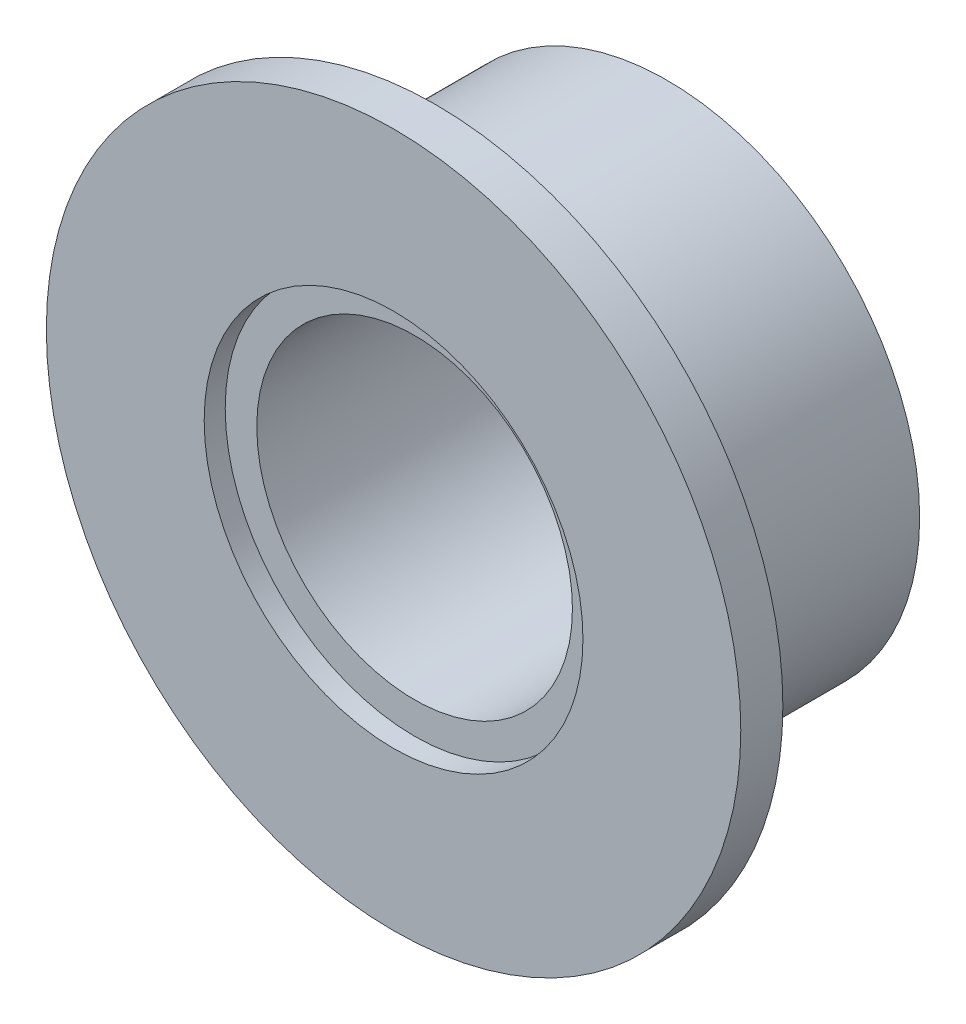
from build123d import *

# Parameters (mm, degrees)
SKETCH2_R           = 12
BOSS_EXTRUDE2_DEPTH = 11
SKETCH3_R           = 16.5
BOSS_EXTRUDE3_DEPTH = 2
HOLE1_D             = 15
HOLE1_DEPTH         = 12999.999913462
HOLE1_CBORE_D       = 18
HOLE1_CBORE_DEPTH   = 1


with BuildPart() as part:
    # Sketch2 → Boss-Extrude2 (new body)
    with BuildSketch(Plane.XY):
        Circle(SKETCH2_R)
    extrude(amount=BOSS_EXTRUDE2_DEPTH)

    # Sketch3 → Boss-Extrude3 (add)
    with BuildSketch(Plane.XY.offset(11)):
        Circle(SKETCH3_R)
    extrude(amount=BOSS_EXTRUDE3_DEPTH)

    # Hole1
    with Locations(Plane.XY.offset(13)):
        with Locations((0, 0)):
            CounterBoreHole(HOLE1_D / 2, HOLE1_CBORE_D / 2, HOLE1_CBORE_DEPTH, depth=HOLE1_DEPTH)


solid = part.part
